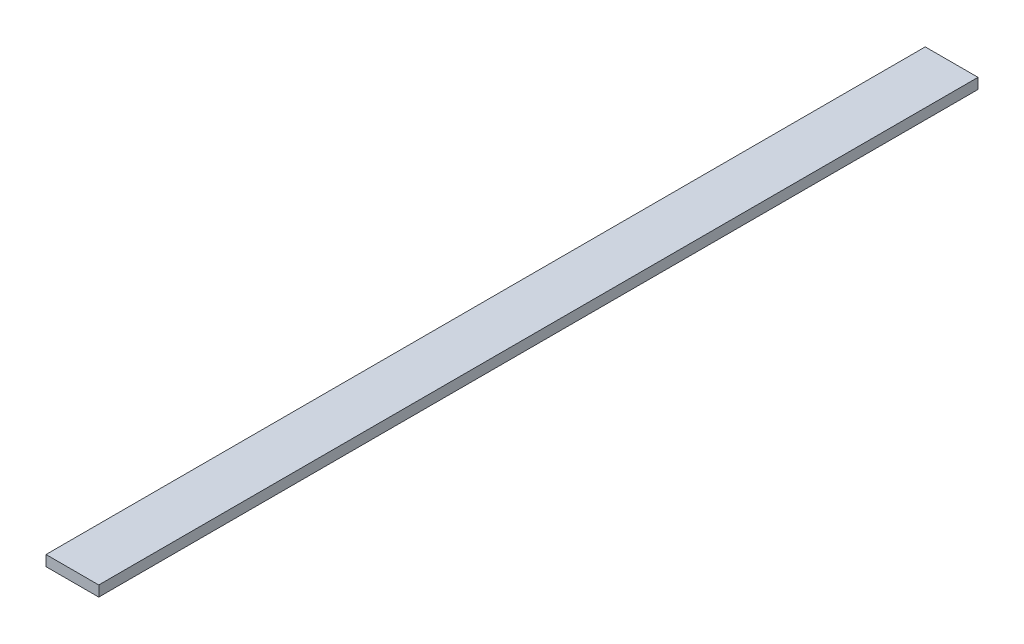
ISO-10303-21;
HEADER;
FILE_DESCRIPTION(('STEP AP214'),'2;1');
FILE_NAME('part.step','',(''),(''),'','','');
FILE_SCHEMA(('AUTOMOTIVE_DESIGN { 1 0 10303 214 1 1 1 1 }'));
ENDSEC;
DATA;
#1=APPLICATION_CONTEXT('core data for automotive mechanical design processes');
#2=APPLICATION_PROTOCOL_DEFINITION('international standard','automotive_design',2000,#1);
#3=PRODUCT_CONTEXT('',#1,'mechanical');
#4=PRODUCT('Part','Part','',(#3));
#5=PRODUCT_RELATED_PRODUCT_CATEGORY('part','',(#4));
#6=PRODUCT_DEFINITION_FORMATION('','',#4);
#7=PRODUCT_DEFINITION_CONTEXT('part definition',#1,'design');
#8=PRODUCT_DEFINITION('design','',#6,#7);
#9=PRODUCT_DEFINITION_SHAPE('','',#8);
#10=(LENGTH_UNIT() NAMED_UNIT(*) SI_UNIT(.MILLI.,.METRE.));
#11=(NAMED_UNIT(*) PLANE_ANGLE_UNIT() SI_UNIT($,.RADIAN.));
#12=(NAMED_UNIT(*) SI_UNIT($,.STERADIAN.) SOLID_ANGLE_UNIT());
#13=UNCERTAINTY_MEASURE_WITH_UNIT(LENGTH_MEASURE(1.E-05),#10,'distance_accuracy_value','');
#14=(GEOMETRIC_REPRESENTATION_CONTEXT(3) GLOBAL_UNCERTAINTY_ASSIGNED_CONTEXT((#13)) GLOBAL_UNIT_ASSIGNED_CONTEXT((#10,
#11,#12)) REPRESENTATION_CONTEXT('',''));
#15=CARTESIAN_POINT('',(0.,0.,0.));
#16=DIRECTION('',(0.,0.,1.));
#17=DIRECTION('',(1.,0.,0.));
#18=AXIS2_PLACEMENT_3D('',#15,#16,#17);
#19=CARTESIAN_POINT('',(-15.,6.,1900.));
#20=DIRECTION('',(1.,0.,0.));
#21=DIRECTION('',(0.,0.,-1.));
#22=AXIS2_PLACEMENT_3D('',#19,#20,#21);
#23=PLANE('',#22);
#24=DIRECTION('',(0.,-1.,0.));
#25=VECTOR('',#24,1.);
#26=CARTESIAN_POINT('',(-15.,6.,500.));
#27=LINE('',#26,#25);
#28=CARTESIAN_POINT('',(-15.,6.,500.));
#29=VERTEX_POINT('',#28);
#30=CARTESIAN_POINT('',(-15.,0.,500.));
#31=VERTEX_POINT('',#30);
#32=EDGE_CURVE('E54',#29,#31,#27,.T.);
#33=ORIENTED_EDGE('',*,*,#32,.F.);
#34=DIRECTION('',(0.,0.,-1.));
#35=VECTOR('',#34,1.);
#36=CARTESIAN_POINT('',(-15.,6.,1900.));
#37=LINE('',#36,#35);
#38=CARTESIAN_POINT('',(-15.,6.,0.));
#39=VERTEX_POINT('',#38);
#40=EDGE_CURVE('E36',#29,#39,#37,.T.);
#41=ORIENTED_EDGE('',*,*,#40,.T.);
#42=DIRECTION('',(0.,-1.,0.));
#43=VECTOR('',#42,1.);
#44=CARTESIAN_POINT('',(-15.,6.,0.));
#45=LINE('',#44,#43);
#46=CARTESIAN_POINT('',(-15.,0.,0.));
#47=VERTEX_POINT('',#46);
#48=EDGE_CURVE('E83',#39,#47,#45,.T.);
#49=ORIENTED_EDGE('',*,*,#48,.T.);
#50=DIRECTION('',(0.,0.,-1.));
#51=VECTOR('',#50,1.);
#52=CARTESIAN_POINT('',(-15.,0.,1900.));
#53=LINE('',#52,#51);
#54=EDGE_CURVE('E9',#31,#47,#53,.T.);
#55=ORIENTED_EDGE('',*,*,#54,.F.);
#56=EDGE_LOOP('',(#33,#41,#49,#55));
#57=FACE_BOUND('',#56,.T.);
#58=ADVANCED_FACE('F14',(#57),#23,.F.);
#59=CARTESIAN_POINT('',(-15.,0.,1900.));
#60=DIRECTION('',(0.,1.,0.));
#61=DIRECTION('',(-1.,0.,0.));
#62=AXIS2_PLACEMENT_3D('',#59,#60,#61);
#63=PLANE('',#62);
#64=DIRECTION('',(1.,0.,0.));
#65=VECTOR('',#64,1.);
#66=CARTESIAN_POINT('',(-15.,0.,500.));
#67=LINE('',#66,#65);
#68=CARTESIAN_POINT('',(15.,0.,500.));
#69=VERTEX_POINT('',#68);
#70=EDGE_CURVE('E60',#31,#69,#67,.T.);
#71=ORIENTED_EDGE('',*,*,#70,.F.);
#72=ORIENTED_EDGE('',*,*,#54,.T.);
#73=DIRECTION('',(1.,0.,0.));
#74=VECTOR('',#73,1.);
#75=CARTESIAN_POINT('',(-15.,0.,0.));
#76=LINE('',#75,#74);
#77=CARTESIAN_POINT('',(15.,0.,0.));
#78=VERTEX_POINT('',#77);
#79=EDGE_CURVE('E80',#47,#78,#76,.T.);
#80=ORIENTED_EDGE('',*,*,#79,.T.);
#81=DIRECTION('',(0.,0.,-1.));
#82=VECTOR('',#81,1.);
#83=CARTESIAN_POINT('',(15.,0.,1900.));
#84=LINE('',#83,#82);
#85=EDGE_CURVE('E21',#69,#78,#84,.T.);
#86=ORIENTED_EDGE('',*,*,#85,.F.);
#87=EDGE_LOOP('',(#71,#72,#80,#86));
#88=FACE_BOUND('',#87,.T.);
#89=ADVANCED_FACE('F81',(#88),#63,.F.);
#90=CARTESIAN_POINT('',(15.,6.,1900.));
#91=DIRECTION('',(-1.,0.,0.));
#92=DIRECTION('',(0.,0.,1.));
#93=AXIS2_PLACEMENT_3D('',#90,#91,#92);
#94=PLANE('',#93);
#95=DIRECTION('',(0.,1.,0.));
#96=VECTOR('',#95,1.);
#97=CARTESIAN_POINT('',(15.,0.,500.));
#98=LINE('',#97,#96);
#99=CARTESIAN_POINT('',(15.,6.,500.));
#100=VERTEX_POINT('',#99);
#101=EDGE_CURVE('E28',#69,#100,#98,.T.);
#102=ORIENTED_EDGE('',*,*,#101,.F.);
#103=ORIENTED_EDGE('',*,*,#85,.T.);
#104=DIRECTION('',(0.,1.,0.));
#105=VECTOR('',#104,1.);
#106=CARTESIAN_POINT('',(15.,6.,0.));
#107=LINE('',#106,#105);
#108=CARTESIAN_POINT('',(15.,6.,0.));
#109=VERTEX_POINT('',#108);
#110=EDGE_CURVE('E69',#78,#109,#107,.T.);
#111=ORIENTED_EDGE('',*,*,#110,.T.);
#112=DIRECTION('',(0.,0.,-1.));
#113=VECTOR('',#112,1.);
#114=CARTESIAN_POINT('',(15.,6.,1900.));
#115=LINE('',#114,#113);
#116=EDGE_CURVE('E66',#100,#109,#115,.T.);
#117=ORIENTED_EDGE('',*,*,#116,.F.);
#118=EDGE_LOOP('',(#102,#103,#111,#117));
#119=FACE_BOUND('',#118,.T.);
#120=ADVANCED_FACE('F76',(#119),#94,.F.);
#121=CARTESIAN_POINT('',(-15.,6.,1900.));
#122=DIRECTION('',(0.,-1.,0.));
#123=DIRECTION('',(0.,0.,-1.));
#124=AXIS2_PLACEMENT_3D('',#121,#122,#123);
#125=PLANE('',#124);
#126=DIRECTION('',(-1.,0.,0.));
#127=VECTOR('',#126,1.);
#128=CARTESIAN_POINT('',(15.,6.,500.));
#129=LINE('',#128,#127);
#130=EDGE_CURVE('E52',#100,#29,#129,.T.);
#131=ORIENTED_EDGE('',*,*,#130,.F.);
#132=ORIENTED_EDGE('',*,*,#116,.T.);
#133=DIRECTION('',(-1.,0.,0.));
#134=VECTOR('',#133,1.);
#135=CARTESIAN_POINT('',(-15.,6.,0.));
#136=LINE('',#135,#134);
#137=EDGE_CURVE('E64',#109,#39,#136,.T.);
#138=ORIENTED_EDGE('',*,*,#137,.T.);
#139=ORIENTED_EDGE('',*,*,#40,.F.);
#140=EDGE_LOOP('',(#131,#132,#138,#139));
#141=FACE_BOUND('',#140,.T.);
#142=ADVANCED_FACE('F62',(#141),#125,.F.);
#143=CARTESIAN_POINT('',(-15.,6.,0.));
#144=DIRECTION('',(0.,0.,1.));
#145=DIRECTION('',(1.,0.,0.));
#146=AXIS2_PLACEMENT_3D('',#143,#144,#145);
#147=PLANE('',#146);
#148=ORIENTED_EDGE('',*,*,#48,.F.);
#149=ORIENTED_EDGE('',*,*,#137,.F.);
#150=ORIENTED_EDGE('',*,*,#110,.F.);
#151=ORIENTED_EDGE('',*,*,#79,.F.);
#152=EDGE_LOOP('',(#148,#149,#150,#151));
#153=FACE_BOUND('',#152,.T.);
#154=ADVANCED_FACE('F85',(#153),#147,.F.);
#155=CARTESIAN_POINT('',(-15.,6.,500.));
#156=DIRECTION('',(0.,0.,1.));
#157=DIRECTION('',(1.,0.,0.));
#158=AXIS2_PLACEMENT_3D('',#155,#156,#157);
#159=PLANE('',#158);
#160=ORIENTED_EDGE('',*,*,#130,.T.);
#161=ORIENTED_EDGE('',*,*,#32,.T.);
#162=ORIENTED_EDGE('',*,*,#70,.T.);
#163=ORIENTED_EDGE('',*,*,#101,.T.);
#164=EDGE_LOOP('',(#160,#161,#162,#163));
#165=FACE_BOUND('',#164,.T.);
#166=ADVANCED_FACE('F53',(#165),#159,.T.);
#167=CLOSED_SHELL('',(#58,#89,#120,#142,#154,#166));
#168=MANIFOLD_SOLID_BREP('B1',#167);
#169=ADVANCED_BREP_SHAPE_REPRESENTATION('',(#18,#168),#14);
#170=SHAPE_DEFINITION_REPRESENTATION(#9,#169);
ENDSEC;
END-ISO-10303-21;
